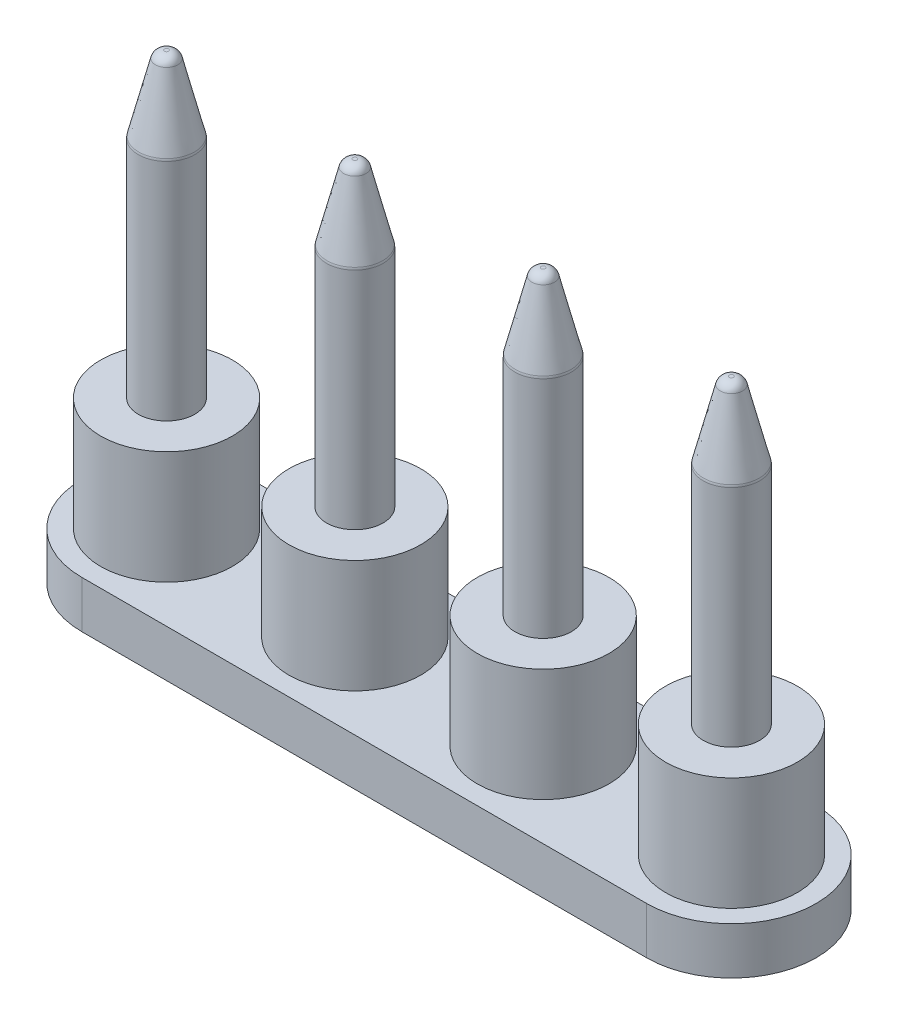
from build123d import *
from OCP.BRepFilletAPI import BRepFilletAPI_MakeChamfer

# Parameters (mm, degrees)
EXTRUSION1_DEPTH  = 2.5
ESQUISSE2_R       = 3.5
EXTRUSION2_DEPTH  = 6
ESQUISSE3_R       = 3.5
EXTRUSION3_DEPTH  = 6
ESQUISSE4_R       = 3.5
EXTRUSION4_DEPTH  = 6
ESQUISSE5_R       = 3.5
EXTRUSION5_DEPTH  = 6
ESQUISSE7_R       = 1.5
EXTRUSION7_DEPTH  = 16
ESQUISSE8_R       = 1.5
EXTRUSION8_DEPTH  = 16
ESQUISSE9_R       = 1.5
EXTRUSION9_DEPTH  = 16
EXTRUSION13_DEPTH = 2.5
ESQUISSE14_R      = 1.5
EXTRUSION14_DEPTH = 16
CHANFREIN1_SIZE   = 4
CHANFREIN1_SIZE2  = 1
CONG_2_R          = 0.5


with BuildPart() as part:
    # Esquisse1 → Extrusion1 (new body)
    with BuildSketch(Plane(origin=(0, 0, 0), x_dir=(1, 0, 0), z_dir=(0, 1, 0))):
        with BuildLine():
            Line((-15, 4.5), (15, 4.5))
            ThreePointArc((15, 4.5), (19.5, 0), (15, -4.5))
            Line((15, -4.5), (-15, -4.5))
            ThreePointArc((-15, -4.5), (-19.5, 0), (-15, 4.5))
        make_face()
    extrude(amount=EXTRUSION1_DEPTH)

    # Esquisse2 → Extrusion2 (add)
    with BuildSketch(Plane(origin=(0, 2.5, 0), x_dir=(-1, 0, 0), z_dir=(0, 1, 0))):
        with Locations(Location((-15, 0, 0), (0, 0, 90))):
            Circle(ESQUISSE2_R)
    extrude(amount=EXTRUSION2_DEPTH)

    # Esquisse3 → Extrusion3 (add)
    with BuildSketch(Plane(origin=(0, 2.5, 0), x_dir=(-1, 0, 0), z_dir=(0, 1, 0))):
        with Locations(Location((15, 0, 0), (0, 0, 90))):
            Circle(ESQUISSE3_R)
    extrude(amount=EXTRUSION3_DEPTH)

    # Esquisse4 → Extrusion4 (add)
    with BuildSketch(Plane(origin=(0, 2.5, 0), x_dir=(-1, 0, 0), z_dir=(0, 1, 0))):
        with Locations(Location((-5, 0, 0), (0, 0, 90))):
            Circle(ESQUISSE4_R)
    extrude(amount=EXTRUSION4_DEPTH)

    # Esquisse5 → Extrusion5 (add)
    with BuildSketch(Plane(origin=(0, 2.5, 0), x_dir=(-1, 0, 0), z_dir=(0, 1, 0))):
        with Locations(Location((5, 0, 0), (0, 0, 90))):
            Circle(ESQUISSE5_R)
    extrude(amount=EXTRUSION5_DEPTH)

    # Esquisse7 → Extrusion7 (add)
    with BuildSketch(Plane(origin=(0, 8.5, 0), x_dir=(-1, 0, 0), z_dir=(0, 1, 0))):
        with Locations(Location((-5, 0, 0), (0, 0, 90))):
            Circle(ESQUISSE7_R)
    extrude(amount=EXTRUSION7_DEPTH)

    # Esquisse8 → Extrusion8 (add)
    with BuildSketch(Plane(origin=(0, 8.5, 0), x_dir=(-1, 0, 0), z_dir=(0, 1, 0))):
        with Locations(Location((5, 0, 0), (0, 0, 90))):
            Circle(ESQUISSE8_R)
    extrude(amount=EXTRUSION8_DEPTH)

    # Esquisse9 → Extrusion9 (add)
    with BuildSketch(Plane(origin=(0, 8.5, 0), x_dir=(-1, 0, 0), z_dir=(0, 1, 0))):
        with Locations(Location((15, 0, 0), (0, 0, 90))):
            Circle(ESQUISSE9_R)
    extrude(amount=EXTRUSION9_DEPTH)

    # Esquisse13 → Extrusion13 (add)
    with BuildSketch(Plane.XZ):
        with BuildLine():
            Line((2.999980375, -4.5), (-2.999980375, -4.5))
            ThreePointArc((-2.999980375, -4.5), (0, -7.510851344), (2.999980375, -4.5))
        make_face()
    extrude(amount=-EXTRUSION13_DEPTH)

    # Esquisse14 → Extrusion14 (add)
    with BuildSketch(Plane(origin=(0, 8.5, 0), x_dir=(-1, 0, 0), z_dir=(0, 1, 0))):
        with Locations(Location((-15, 0, 0), (0, 0, 90))):
            Circle(ESQUISSE14_R)
    extrude(amount=EXTRUSION14_DEPTH)

    # Chanfrein1: one chamfer whose edges measure the first distance from different faces: ONE call of the kernel's chamfer builder (chamfer() names one face for all edges)
    chanfrein1_edges_1 = [part.edges().sort_by_distance(p)[0] for p in [
        (5, 24.5, -1.5),
    ]]
    chanfrein1_side_1 = [part.faces().sort_by_distance(p)[0] for p in [
        (5, 16.5, -1.5),
    ]]
    chanfrein1_edges_2 = [part.edges().sort_by_distance(p)[0] for p in [
        (-5, 24.5, -1.5),
    ]]
    chanfrein1_side_2 = [part.faces().sort_by_distance(p)[0] for p in [
        (-5, 16.5, -1.5),
    ]]
    chanfrein1_edges_3 = [part.edges().sort_by_distance(p)[0] for p in [
        (-15, 24.5, -1.5),
    ]]
    chanfrein1_side_3 = [part.faces().sort_by_distance(p)[0] for p in [
        (-15, 16.5, -1.5),
    ]]
    chanfrein1_edges_4 = [part.edges().sort_by_distance(p)[0] for p in [
        (15, 24.5, -1.5),
    ]]
    chanfrein1_side_4 = [part.faces().sort_by_distance(p)[0] for p in [
        (15, 16.5, -1.5),
    ]]
    chanfrein1 = BRepFilletAPI_MakeChamfer(part.part.solid().wrapped)
    for e in chanfrein1_edges_1:
        chanfrein1.Add(CHANFREIN1_SIZE, CHANFREIN1_SIZE2, e.wrapped, chanfrein1_side_1[0].wrapped)  # the first distance lies on this face
    for e in chanfrein1_edges_2:
        chanfrein1.Add(CHANFREIN1_SIZE, CHANFREIN1_SIZE2, e.wrapped, chanfrein1_side_2[0].wrapped)  # the first distance lies on this face
    for e in chanfrein1_edges_3:
        chanfrein1.Add(CHANFREIN1_SIZE, CHANFREIN1_SIZE2, e.wrapped, chanfrein1_side_3[0].wrapped)  # the first distance lies on this face
    for e in chanfrein1_edges_4:
        chanfrein1.Add(CHANFREIN1_SIZE, CHANFREIN1_SIZE2, e.wrapped, chanfrein1_side_4[0].wrapped)  # the first distance lies on this face
    add(Compound.cast(chanfrein1.Shape()), mode=Mode.REPLACE)

    # Cong_2
    cong_2_edges = [part.edges().sort_by_distance(p)[0] for p in [
        (15, 24.5, -0.5),
        (15, 20.5, -1.5),
        (5, 24.5, -0.5),
        (5, 20.5, -1.5),
        (-5, 24.5, -0.5),
        (-5, 20.5, -1.5),
        (-15, 24.5, -0.5),
        (-15, 20.5, -1.5),
    ]]
    fillet(cong_2_edges, radius=CONG_2_R)


solid = part.part
